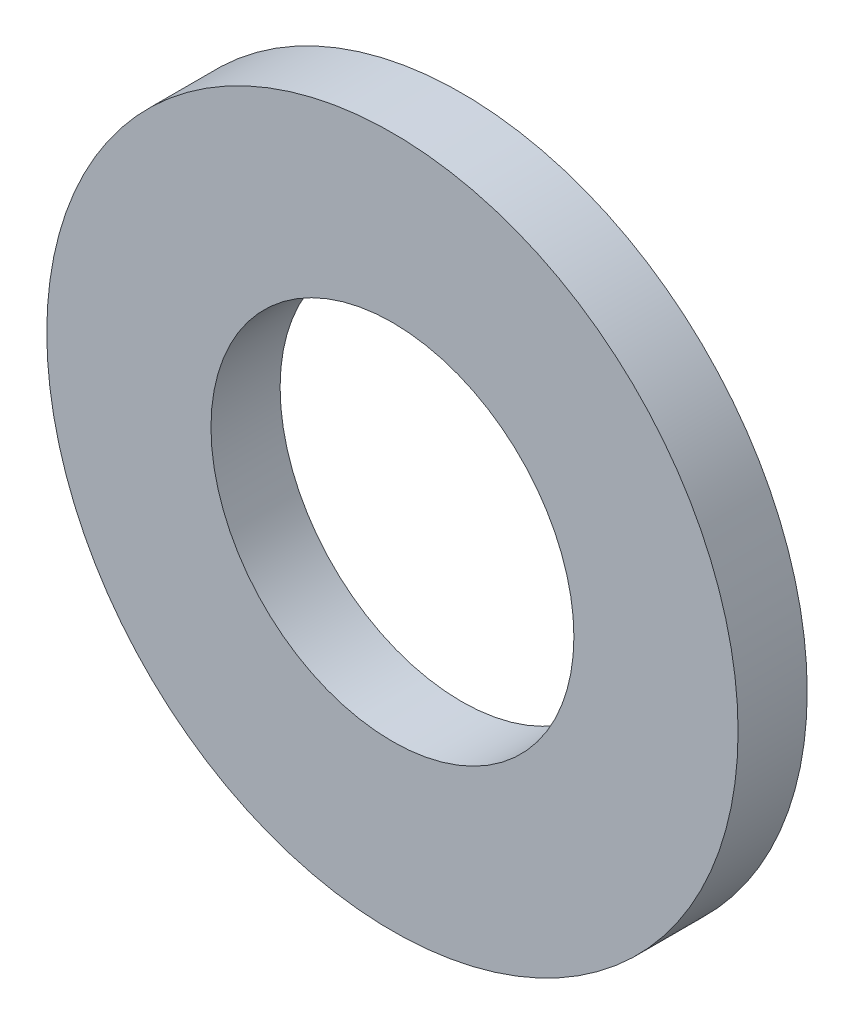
from build123d import *

# Parameters (mm, degrees)
ESQUISSE1_R        = 10
ESQUISSE1_R_2      = 5.25
BOSS_EXTRU_1_DEPTH = 2


with BuildPart() as part:
    # Esquisse1 → Boss.-Extru.1 (new body)
    with BuildSketch(Plane.XY):
        Circle(ESQUISSE1_R)
        Circle(ESQUISSE1_R_2, mode=Mode.SUBTRACT)
    extrude(amount=BOSS_EXTRU_1_DEPTH)


solid = part.part
